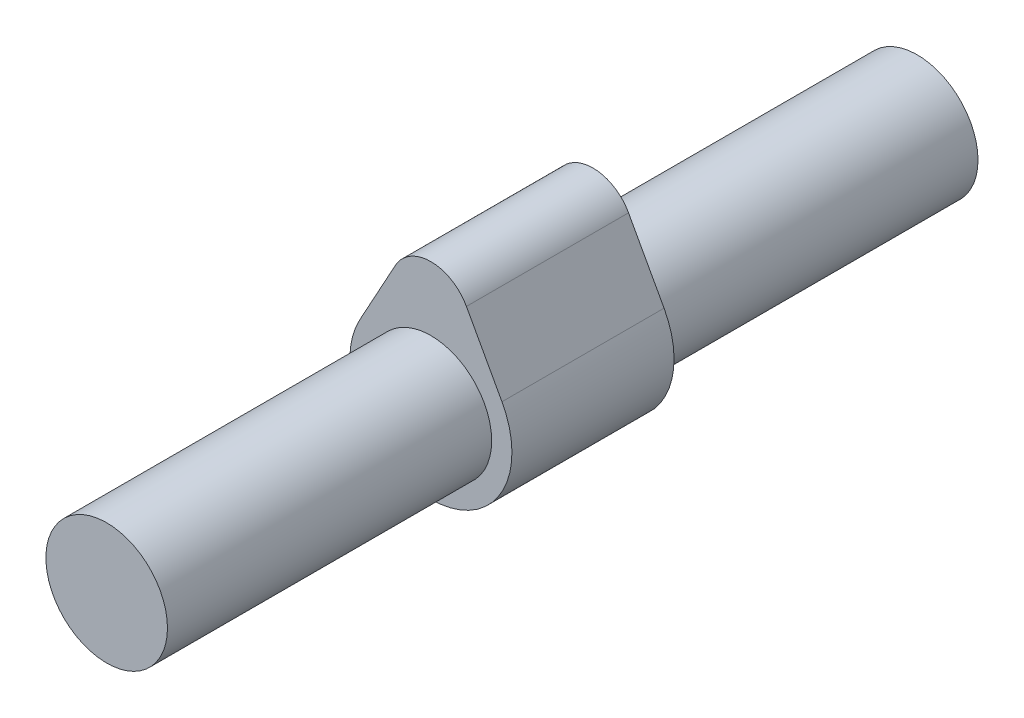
from build123d import *

# Parameters (mm, degrees)
EXTRUDE1_DEPTH      = 63.5
EXTRUDE1_DEPTH_BACK = 63.5
SKETCH1_R           = 9.525
EXTRUDE2_DEPTH      = 12.7
EXTRUDE2_DEPTH_BACK = 12.7


with BuildPart() as part:
    # Sketch1 → Extrude1 (new, two sides: drawn at the far end of the back side and taken through both)
    with BuildSketch(Plane.XY.offset(-EXTRUDE1_DEPTH_BACK)):
        Circle(SKETCH1_R)
    extrude(amount=EXTRUDE1_DEPTH + EXTRUDE1_DEPTH_BACK)

    # Sketch2 → Extrude2 (add, two sides: drawn at the far end of the back side and taken through both)
    with BuildSketch(Plane.XY.offset(-EXTRUDE2_DEPTH_BACK)):
        with BuildLine():
            Line((-5.567979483, 16.260884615), (-11.135958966, 6.105769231))
            ThreePointArc((-11.135958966, 6.105769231), (0, -12.7), (11.135958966, 6.105769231))
            Line((11.135958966, 6.105769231), (5.567979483, 16.260884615))
            ThreePointArc((5.567979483, 16.260884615), (0, 19.558), (-5.567979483, 16.260884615))
        make_face()
    extrude(amount=EXTRUDE2_DEPTH + EXTRUDE2_DEPTH_BACK)


solid = part.part
